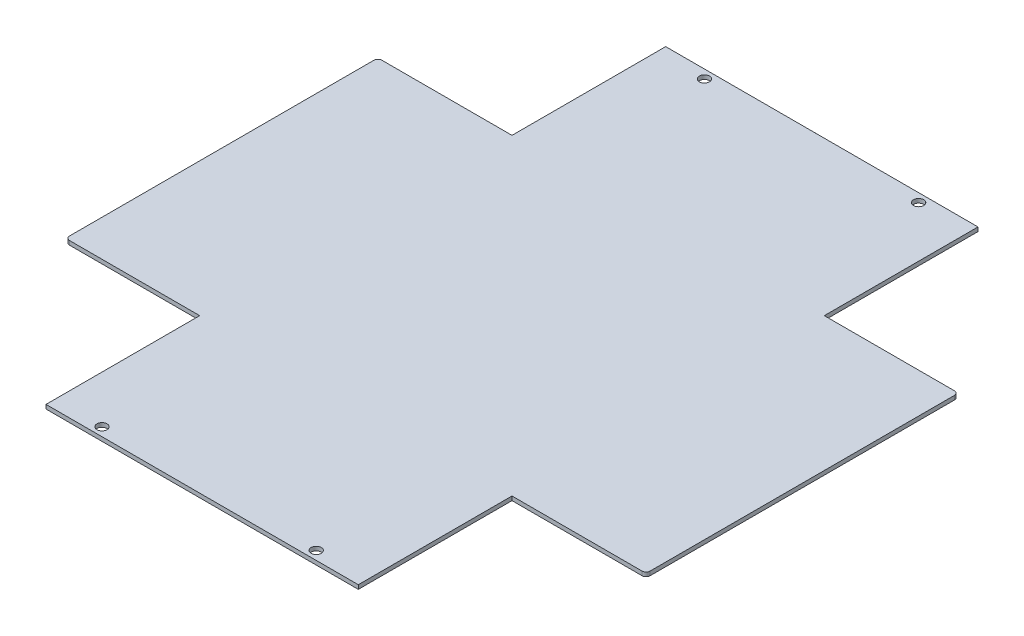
ISO-10303-21;
HEADER;
FILE_DESCRIPTION(('STEP AP214'),'2;1');
FILE_NAME('part.step','',(''),(''),'','','');
FILE_SCHEMA(('AUTOMOTIVE_DESIGN { 1 0 10303 214 1 1 1 1 }'));
ENDSEC;
DATA;
#1=APPLICATION_CONTEXT('core data for automotive mechanical design processes');
#2=APPLICATION_PROTOCOL_DEFINITION('international standard','automotive_design',2000,#1);
#3=PRODUCT_CONTEXT('',#1,'mechanical');
#4=PRODUCT('Part','Part','',(#3));
#5=PRODUCT_RELATED_PRODUCT_CATEGORY('part','',(#4));
#6=PRODUCT_DEFINITION_FORMATION('','',#4);
#7=PRODUCT_DEFINITION_CONTEXT('part definition',#1,'design');
#8=PRODUCT_DEFINITION('design','',#6,#7);
#9=PRODUCT_DEFINITION_SHAPE('','',#8);
#10=(LENGTH_UNIT() NAMED_UNIT(*) SI_UNIT(.MILLI.,.METRE.));
#11=(NAMED_UNIT(*) PLANE_ANGLE_UNIT() SI_UNIT($,.RADIAN.));
#12=(NAMED_UNIT(*) SI_UNIT($,.STERADIAN.) SOLID_ANGLE_UNIT());
#13=UNCERTAINTY_MEASURE_WITH_UNIT(LENGTH_MEASURE(1.E-05),#10,'distance_accuracy_value','');
#14=(GEOMETRIC_REPRESENTATION_CONTEXT(3) GLOBAL_UNCERTAINTY_ASSIGNED_CONTEXT((#13)) GLOBAL_UNIT_ASSIGNED_CONTEXT((#10,
#11,#12)) REPRESENTATION_CONTEXT('',''));
#15=CARTESIAN_POINT('',(0.,0.,0.));
#16=DIRECTION('',(0.,0.,1.));
#17=DIRECTION('',(1.,0.,0.));
#18=AXIS2_PLACEMENT_3D('',#15,#16,#17);
#19=CARTESIAN_POINT('',(0.,1.524,0.));
#20=DIRECTION('',(0.,-1.,0.));
#21=DIRECTION('',(0.,0.,-1.));
#22=AXIS2_PLACEMENT_3D('',#19,#20,#21);
#23=PLANE('',#22);
#24=DIRECTION('',(1.,0.,0.));
#25=VECTOR('',#24,1.);
#26=CARTESIAN_POINT('',(-59.6817953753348,1.524,58.6213948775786));
#27=LINE('',#26,#25);
#28=CARTESIAN_POINT('',(-58.6213948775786,1.52400000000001,58.6213948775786));
#29=VERTEX_POINT('',#28);
#30=CARTESIAN_POINT('',(-107.433795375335,1.52399999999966,58.6213948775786));
#31=VERTEX_POINT('',#30);
#32=EDGE_CURVE('E439',#29,#31,#27,.F.);
#33=ORIENTED_EDGE('',*,*,#32,.F.);
#34=DIRECTION('',(0.,0.,-1.));
#35=VECTOR('',#34,1.);
#36=CARTESIAN_POINT('',(-58.6213948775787,1.52399999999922,167.115590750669));
#37=LINE('',#36,#35);
#38=CARTESIAN_POINT('',(-58.6213948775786,1.52399999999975,116.31559075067));
#39=VERTEX_POINT('',#38);
#40=EDGE_CURVE('E236',#29,#39,#37,.F.);
#41=ORIENTED_EDGE('',*,*,#40,.T.);
#42=DIRECTION('',(-1.,0.,0.));
#43=VECTOR('',#42,1.);
#44=CARTESIAN_POINT('',(0.,1.52399999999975,116.31559075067));
#45=LINE('',#44,#43);
#46=CARTESIAN_POINT('',(58.6213948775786,1.52399999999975,116.31559075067));
#47=VERTEX_POINT('',#46);
#48=EDGE_CURVE('E227',#39,#47,#45,.F.);
#49=ORIENTED_EDGE('',*,*,#48,.T.);
#50=DIRECTION('',(0.,0.,1.));
#51=VECTOR('',#50,1.);
#52=CARTESIAN_POINT('',(58.6213948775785,1.52399999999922,167.11559075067));
#53=LINE('',#52,#51);
#54=CARTESIAN_POINT('',(58.6213948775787,1.524,58.6213948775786));
#55=VERTEX_POINT('',#54);
#56=EDGE_CURVE('E13',#47,#55,#53,.F.);
#57=ORIENTED_EDGE('',*,*,#56,.T.);
#58=DIRECTION('',(1.,0.,0.));
#59=VECTOR('',#58,1.);
#60=CARTESIAN_POINT('',(58.1577953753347,1.52400000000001,58.6213948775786));
#61=LINE('',#60,#59);
#62=CARTESIAN_POINT('',(107.433795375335,1.52399999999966,58.6213948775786));
#63=VERTEX_POINT('',#62);
#64=EDGE_CURVE('E475',#55,#63,#61,.T.);
#65=ORIENTED_EDGE('',*,*,#64,.T.);
#66=CARTESIAN_POINT('',(107.433795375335,1.52399999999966,57.0973948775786));
#67=DIRECTION('',(0.,1.,0.));
#68=DIRECTION('',(-1.,0.,0.));
#69=AXIS2_PLACEMENT_3D('',#66,#67,#68);
#70=CIRCLE('',#69,1.524);
#71=CARTESIAN_POINT('',(108.957795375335,1.52399999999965,57.0973948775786));
#72=VERTEX_POINT('',#71);
#73=EDGE_CURVE('E473',#63,#72,#70,.T.);
#74=ORIENTED_EDGE('',*,*,#73,.T.);
#75=DIRECTION('',(0.,0.,-1.));
#76=VECTOR('',#75,1.);
#77=CARTESIAN_POINT('',(108.957795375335,1.52399999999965,60.325));
#78=LINE('',#77,#76);
#79=CARTESIAN_POINT('',(108.957795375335,1.52399999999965,-57.0973948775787));
#80=VERTEX_POINT('',#79);
#81=EDGE_CURVE('E438',#80,#72,#78,.F.);
#82=ORIENTED_EDGE('',*,*,#81,.F.);
#83=CARTESIAN_POINT('',(107.433795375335,1.52399999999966,-57.0973948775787));
#84=DIRECTION('',(0.,1.,0.));
#85=DIRECTION('',(-1.,0.,0.));
#86=AXIS2_PLACEMENT_3D('',#83,#84,#85);
#87=CIRCLE('',#86,1.524);
#88=CARTESIAN_POINT('',(107.433795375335,1.52399999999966,-58.6213948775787));
#89=VERTEX_POINT('',#88);
#90=EDGE_CURVE('E292',#80,#89,#87,.T.);
#91=ORIENTED_EDGE('',*,*,#90,.T.);
#92=DIRECTION('',(-1.,0.,0.));
#93=VECTOR('',#92,1.);
#94=CARTESIAN_POINT('',(59.6817953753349,1.524,-58.6213948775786));
#95=LINE('',#94,#93);
#96=CARTESIAN_POINT('',(58.6213948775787,1.52400000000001,-58.6213948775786));
#97=VERTEX_POINT('',#96);
#98=EDGE_CURVE('E458',#97,#89,#95,.F.);
#99=ORIENTED_EDGE('',*,*,#98,.F.);
#100=DIRECTION('',(0.,0.,1.));
#101=VECTOR('',#100,1.);
#102=CARTESIAN_POINT('',(58.6213948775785,1.52399999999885,-167.11559075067));
#103=LINE('',#102,#101);
#104=CARTESIAN_POINT('',(58.6213948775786,1.52399999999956,-116.31559075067));
#105=VERTEX_POINT('',#104);
#106=EDGE_CURVE('E340',#97,#105,#103,.F.);
#107=ORIENTED_EDGE('',*,*,#106,.T.);
#108=DIRECTION('',(1.,0.,0.));
#109=VECTOR('',#108,1.);
#110=CARTESIAN_POINT('',(0.,1.52399999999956,-116.31559075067));
#111=LINE('',#110,#109);
#112=CARTESIAN_POINT('',(-58.6213948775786,1.52399999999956,-116.31559075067));
#113=VERTEX_POINT('',#112);
#114=EDGE_CURVE('E418',#105,#113,#111,.F.);
#115=ORIENTED_EDGE('',*,*,#114,.T.);
#116=DIRECTION('',(0.,0.,-1.));
#117=VECTOR('',#116,1.);
#118=CARTESIAN_POINT('',(-58.6213948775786,1.52399999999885,-167.11559075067));
#119=LINE('',#118,#117);
#120=CARTESIAN_POINT('',(-58.6213948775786,1.52400000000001,-58.6213948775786));
#121=VERTEX_POINT('',#120);
#122=EDGE_CURVE('E415',#113,#121,#119,.F.);
#123=ORIENTED_EDGE('',*,*,#122,.T.);
#124=DIRECTION('',(-1.,0.,0.));
#125=VECTOR('',#124,1.);
#126=CARTESIAN_POINT('',(-58.1577953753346,1.52400000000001,-58.6213948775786));
#127=LINE('',#126,#125);
#128=CARTESIAN_POINT('',(-107.433795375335,1.52399999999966,-58.6213948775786));
#129=VERTEX_POINT('',#128);
#130=EDGE_CURVE('E401',#121,#129,#127,.T.);
#131=ORIENTED_EDGE('',*,*,#130,.T.);
#132=CARTESIAN_POINT('',(-107.433795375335,1.52399999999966,-57.0973948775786));
#133=DIRECTION('',(0.,1.,0.));
#134=DIRECTION('',(-1.,0.,0.));
#135=AXIS2_PLACEMENT_3D('',#132,#133,#134);
#136=CIRCLE('',#135,1.524);
#137=CARTESIAN_POINT('',(-108.957795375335,1.52399999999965,-57.0973948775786));
#138=VERTEX_POINT('',#137);
#139=EDGE_CURVE('E450',#129,#138,#136,.T.);
#140=ORIENTED_EDGE('',*,*,#139,.T.);
#141=DIRECTION('',(0.,0.,1.));
#142=VECTOR('',#141,1.);
#143=CARTESIAN_POINT('',(-108.957795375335,1.52399999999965,-60.325));
#144=LINE('',#143,#142);
#145=CARTESIAN_POINT('',(-108.957795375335,1.52399999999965,57.0973948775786));
#146=VERTEX_POINT('',#145);
#147=EDGE_CURVE('E417',#146,#138,#144,.F.);
#148=ORIENTED_EDGE('',*,*,#147,.F.);
#149=CARTESIAN_POINT('',(-107.433795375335,1.52399999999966,57.0973948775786));
#150=DIRECTION('',(0.,1.,0.));
#151=DIRECTION('',(-1.,0.,0.));
#152=AXIS2_PLACEMENT_3D('',#149,#150,#151);
#153=CIRCLE('',#152,1.524);
#154=EDGE_CURVE('E332',#146,#31,#153,.T.);
#155=ORIENTED_EDGE('',*,*,#154,.T.);
#156=EDGE_LOOP('',(#33,#41,#49,#57,#65,#74,#82,#91,#99,#107,#115,#123,#131,#140,#148,#155));
#157=FACE_BOUND('',#156,.T.);
#158=CARTESIAN_POINT('',(39.5732000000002,1.52399999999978,113.077090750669));
#159=DIRECTION('',(0.,-1.,0.));
#160=DIRECTION('',(0.,0.,-1.));
#161=AXIS2_PLACEMENT_3D('',#158,#159,#160);
#162=CIRCLE('',#161,1.90499999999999);
#163=CARTESIAN_POINT('',(39.5732000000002,1.5239999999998,111.172090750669));
#164=VERTEX_POINT('',#163);
#165=EDGE_CURVE('E487',#164,#164,#162,.T.);
#166=ORIENTED_EDGE('',*,*,#165,.T.);
#167=EDGE_LOOP('',(#166));
#168=FACE_BOUND('',#167,.T.);
#169=CARTESIAN_POINT('',(-40.8431999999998,1.52399999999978,113.077090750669));
#170=DIRECTION('',(0.,-1.,0.));
#171=DIRECTION('',(0.,0.,-1.));
#172=AXIS2_PLACEMENT_3D('',#169,#170,#171);
#173=CIRCLE('',#172,1.90499999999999);
#174=CARTESIAN_POINT('',(-40.8431999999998,1.5239999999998,111.17209075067));
#175=VERTEX_POINT('',#174);
#176=EDGE_CURVE('E484',#175,#175,#173,.T.);
#177=ORIENTED_EDGE('',*,*,#176,.T.);
#178=EDGE_LOOP('',(#177));
#179=FACE_BOUND('',#178,.T.);
#180=CARTESIAN_POINT('',(-40.8431999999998,1.5239999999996,-113.07709075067));
#181=DIRECTION('',(0.,-1.,0.));
#182=DIRECTION('',(0.,0.,-1.));
#183=AXIS2_PLACEMENT_3D('',#180,#181,#182);
#184=CIRCLE('',#183,1.90499999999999);
#185=CARTESIAN_POINT('',(-40.8431999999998,1.52399999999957,-114.98209075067));
#186=VERTEX_POINT('',#185);
#187=EDGE_CURVE('E424',#186,#186,#184,.T.);
#188=ORIENTED_EDGE('',*,*,#187,.T.);
#189=EDGE_LOOP('',(#188));
#190=FACE_BOUND('',#189,.T.);
#191=CARTESIAN_POINT('',(39.5732000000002,1.5239999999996,-113.07709075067));
#192=DIRECTION('',(0.,-1.,0.));
#193=DIRECTION('',(0.,0.,-1.));
#194=AXIS2_PLACEMENT_3D('',#191,#192,#193);
#195=CIRCLE('',#194,1.90499999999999);
#196=CARTESIAN_POINT('',(39.5732000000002,1.52399999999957,-114.98209075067));
#197=VERTEX_POINT('',#196);
#198=EDGE_CURVE('E421',#197,#197,#195,.T.);
#199=ORIENTED_EDGE('',*,*,#198,.T.);
#200=EDGE_LOOP('',(#199));
#201=FACE_BOUND('',#200,.T.);
#202=ADVANCED_FACE('F217',(#157,#168,#179,#190,#201),#23,.F.);
#203=CARTESIAN_POINT('',(0.,0.,0.));
#204=DIRECTION('',(0.,-1.,0.));
#205=DIRECTION('',(0.,0.,-1.));
#206=AXIS2_PLACEMENT_3D('',#203,#204,#205);
#207=PLANE('',#206);
#208=DIRECTION('',(0.,0.,-1.));
#209=VECTOR('',#208,1.);
#210=CARTESIAN_POINT('',(58.6213948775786,-4.37150315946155E-13,-116.31559075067));
#211=LINE('',#210,#209);
#212=CARTESIAN_POINT('',(58.6213948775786,0.,-58.6213948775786));
#213=VERTEX_POINT('',#212);
#214=CARTESIAN_POINT('',(58.6213948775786,-4.37150315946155E-13,-116.31559075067));
#215=VERTEX_POINT('',#214);
#216=EDGE_CURVE('E386',#213,#215,#211,.T.);
#217=ORIENTED_EDGE('',*,*,#216,.F.);
#218=DIRECTION('',(1.,0.,0.));
#219=VECTOR('',#218,1.);
#220=CARTESIAN_POINT('',(58.1577953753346,0.,-58.6213948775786));
#221=LINE('',#220,#219);
#222=CARTESIAN_POINT('',(107.433795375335,-3.33066907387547E-13,-58.6213948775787));
#223=VERTEX_POINT('',#222);
#224=EDGE_CURVE('E462',#213,#223,#221,.T.);
#225=ORIENTED_EDGE('',*,*,#224,.T.);
#226=CARTESIAN_POINT('',(107.433795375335,-3.33066907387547E-13,-57.0973948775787));
#227=DIRECTION('',(0.,1.,0.));
#228=DIRECTION('',(-1.,0.,0.));
#229=AXIS2_PLACEMENT_3D('',#226,#227,#228);
#230=CIRCLE('',#229,1.524);
#231=CARTESIAN_POINT('',(108.957795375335,-3.46944695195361E-13,-57.0973948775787));
#232=VERTEX_POINT('',#231);
#233=EDGE_CURVE('E460',#223,#232,#230,.F.);
#234=ORIENTED_EDGE('',*,*,#233,.T.);
#235=DIRECTION('',(0.,0.,1.));
#236=VECTOR('',#235,1.);
#237=CARTESIAN_POINT('',(108.957795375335,-3.46944695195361E-13,0.));
#238=LINE('',#237,#236);
#239=CARTESIAN_POINT('',(108.957795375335,-3.46944695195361E-13,57.0973948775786));
#240=VERTEX_POINT('',#239);
#241=EDGE_CURVE('E466',#232,#240,#238,.T.);
#242=ORIENTED_EDGE('',*,*,#241,.T.);
#243=CARTESIAN_POINT('',(107.433795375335,-3.33066907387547E-13,57.0973948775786));
#244=DIRECTION('',(0.,1.,0.));
#245=DIRECTION('',(-1.,0.,0.));
#246=AXIS2_PLACEMENT_3D('',#243,#244,#245);
#247=CIRCLE('',#246,1.524);
#248=CARTESIAN_POINT('',(107.433795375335,-3.33066907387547E-13,58.6213948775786));
#249=VERTEX_POINT('',#248);
#250=EDGE_CURVE('E464',#240,#249,#247,.F.);
#251=ORIENTED_EDGE('',*,*,#250,.T.);
#252=DIRECTION('',(-1.,0.,0.));
#253=VECTOR('',#252,1.);
#254=CARTESIAN_POINT('',(59.6817953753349,0.,58.6213948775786));
#255=LINE('',#254,#253);
#256=CARTESIAN_POINT('',(58.6213948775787,0.,58.6213948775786));
#257=VERTEX_POINT('',#256);
#258=EDGE_CURVE('E362',#257,#249,#255,.F.);
#259=ORIENTED_EDGE('',*,*,#258,.F.);
#260=DIRECTION('',(0.,0.,-1.));
#261=VECTOR('',#260,1.);
#262=CARTESIAN_POINT('',(58.6213948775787,-1.59594559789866E-13,108.31459075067));
#263=LINE('',#262,#261);
#264=CARTESIAN_POINT('',(58.6213948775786,-2.42861286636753E-13,116.31559075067));
#265=VERTEX_POINT('',#264);
#266=EDGE_CURVE('E494',#265,#257,#263,.T.);
#267=ORIENTED_EDGE('',*,*,#266,.F.);
#268=DIRECTION('',(1.,0.,0.));
#269=VECTOR('',#268,1.);
#270=CARTESIAN_POINT('',(58.6213948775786,-2.42861286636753E-13,116.31559075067));
#271=LINE('',#270,#269);
#272=CARTESIAN_POINT('',(-58.6213948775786,-2.42861286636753E-13,116.31559075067));
#273=VERTEX_POINT('',#272);
#274=EDGE_CURVE('E221',#273,#265,#271,.T.);
#275=ORIENTED_EDGE('',*,*,#274,.F.);
#276=DIRECTION('',(0.,0.,1.));
#277=VECTOR('',#276,1.);
#278=CARTESIAN_POINT('',(-58.6213948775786,-2.42861286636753E-13,116.31559075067));
#279=LINE('',#278,#277);
#280=CARTESIAN_POINT('',(-58.6213948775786,0.,58.6213948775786));
#281=VERTEX_POINT('',#280);
#282=EDGE_CURVE('E492',#281,#273,#279,.T.);
#283=ORIENTED_EDGE('',*,*,#282,.F.);
#284=DIRECTION('',(-1.,0.,0.));
#285=VECTOR('',#284,1.);
#286=CARTESIAN_POINT('',(-58.1577953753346,0.,58.6213948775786));
#287=LINE('',#286,#285);
#288=CARTESIAN_POINT('',(-107.433795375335,-3.33066907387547E-13,58.6213948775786));
#289=VERTEX_POINT('',#288);
#290=EDGE_CURVE('E443',#281,#289,#287,.T.);
#291=ORIENTED_EDGE('',*,*,#290,.T.);
#292=CARTESIAN_POINT('',(-107.433795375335,-3.33066907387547E-13,57.0973948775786));
#293=DIRECTION('',(0.,1.,0.));
#294=DIRECTION('',(-1.,0.,0.));
#295=AXIS2_PLACEMENT_3D('',#292,#293,#294);
#296=CIRCLE('',#295,1.524);
#297=CARTESIAN_POINT('',(-108.957795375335,-3.46944695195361E-13,57.0973948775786));
#298=VERTEX_POINT('',#297);
#299=EDGE_CURVE('E441',#289,#298,#296,.F.);
#300=ORIENTED_EDGE('',*,*,#299,.T.);
#301=DIRECTION('',(0.,0.,-1.));
#302=VECTOR('',#301,1.);
#303=CARTESIAN_POINT('',(-108.957795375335,-3.46944695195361E-13,0.));
#304=LINE('',#303,#302);
#305=CARTESIAN_POINT('',(-108.957795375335,-3.46944695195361E-13,-57.0973948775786));
#306=VERTEX_POINT('',#305);
#307=EDGE_CURVE('E446',#298,#306,#304,.T.);
#308=ORIENTED_EDGE('',*,*,#307,.T.);
#309=CARTESIAN_POINT('',(-107.433795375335,-3.33066907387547E-13,-57.0973948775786));
#310=DIRECTION('',(0.,1.,0.));
#311=DIRECTION('',(-1.,0.,0.));
#312=AXIS2_PLACEMENT_3D('',#309,#310,#311);
#313=CIRCLE('',#312,1.524);
#314=CARTESIAN_POINT('',(-107.433795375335,-3.33066907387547E-13,-58.6213948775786));
#315=VERTEX_POINT('',#314);
#316=EDGE_CURVE('E393',#306,#315,#313,.F.);
#317=ORIENTED_EDGE('',*,*,#316,.T.);
#318=DIRECTION('',(1.,0.,0.));
#319=VECTOR('',#318,1.);
#320=CARTESIAN_POINT('',(-59.6817953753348,0.,-58.6213948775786));
#321=LINE('',#320,#319);
#322=CARTESIAN_POINT('',(-58.6213948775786,0.,-58.6213948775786));
#323=VERTEX_POINT('',#322);
#324=EDGE_CURVE('E390',#323,#315,#321,.F.);
#325=ORIENTED_EDGE('',*,*,#324,.F.);
#326=DIRECTION('',(0.,0.,1.));
#327=VECTOR('',#326,1.);
#328=CARTESIAN_POINT('',(-58.6213948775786,-3.2612801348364E-13,-108.31459075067));
#329=LINE('',#328,#327);
#330=CARTESIAN_POINT('',(-58.6213948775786,-4.37150315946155E-13,-116.31559075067));
#331=VERTEX_POINT('',#330);
#332=EDGE_CURVE('E380',#331,#323,#329,.T.);
#333=ORIENTED_EDGE('',*,*,#332,.F.);
#334=DIRECTION('',(-1.,0.,0.));
#335=VECTOR('',#334,1.);
#336=CARTESIAN_POINT('',(-58.6213948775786,-4.37150315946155E-13,-116.31559075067));
#337=LINE('',#336,#335);
#338=EDGE_CURVE('E414',#215,#331,#337,.T.);
#339=ORIENTED_EDGE('',*,*,#338,.F.);
#340=EDGE_LOOP('',(#217,#225,#234,#242,#251,#259,#267,#275,#283,#291,#300,#308,#317,#325,#333,#339));
#341=FACE_BOUND('',#340,.T.);
#342=CARTESIAN_POINT('',(39.5732000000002,-2.08166817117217E-13,113.077090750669));
#343=DIRECTION('',(0.,-1.,0.));
#344=DIRECTION('',(0.,0.,-1.));
#345=AXIS2_PLACEMENT_3D('',#342,#343,#344);
#346=CIRCLE('',#345,1.90499999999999);
#347=CARTESIAN_POINT('',(39.5732000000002,-1.87925379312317E-13,111.172090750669));
#348=VERTEX_POINT('',#347);
#349=EDGE_CURVE('E496',#348,#348,#346,.T.);
#350=ORIENTED_EDGE('',*,*,#349,.F.);
#351=EDGE_LOOP('',(#350));
#352=FACE_BOUND('',#351,.T.);
#353=CARTESIAN_POINT('',(-40.8431999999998,-2.08166817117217E-13,113.077090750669));
#354=DIRECTION('',(0.,-1.,0.));
#355=DIRECTION('',(0.,0.,-1.));
#356=AXIS2_PLACEMENT_3D('',#353,#354,#355);
#357=CIRCLE('',#356,1.90499999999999);
#358=CARTESIAN_POINT('',(-40.8431999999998,-1.87925379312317E-13,111.172090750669));
#359=VERTEX_POINT('',#358);
#360=EDGE_CURVE('E499',#359,#359,#357,.T.);
#361=ORIENTED_EDGE('',*,*,#360,.F.);
#362=EDGE_LOOP('',(#361));
#363=FACE_BOUND('',#362,.T.);
#364=CARTESIAN_POINT('',(-40.8431999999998,-7.63278329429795E-13,-113.07709075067));
#365=DIRECTION('',(0.,-1.,0.));
#366=DIRECTION('',(0.,0.,-1.));
#367=AXIS2_PLACEMENT_3D('',#364,#365,#366);
#368=CIRCLE('',#367,1.90499999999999);
#369=CARTESIAN_POINT('',(-40.8431999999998,-7.6964197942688E-13,-114.98209075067));
#370=VERTEX_POINT('',#369);
#371=EDGE_CURVE('E387',#370,#370,#368,.T.);
#372=ORIENTED_EDGE('',*,*,#371,.F.);
#373=EDGE_LOOP('',(#372));
#374=FACE_BOUND('',#373,.T.);
#375=CARTESIAN_POINT('',(39.5732000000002,-7.63278329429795E-13,-113.07709075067));
#376=DIRECTION('',(0.,-1.,0.));
#377=DIRECTION('',(0.,0.,-1.));
#378=AXIS2_PLACEMENT_3D('',#375,#376,#377);
#379=CIRCLE('',#378,1.90499999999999);
#380=CARTESIAN_POINT('',(39.5732000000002,-7.6964197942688E-13,-114.98209075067));
#381=VERTEX_POINT('',#380);
#382=EDGE_CURVE('E432',#381,#381,#379,.T.);
#383=ORIENTED_EDGE('',*,*,#382,.F.);
#384=EDGE_LOOP('',(#383));
#385=FACE_BOUND('',#384,.T.);
#386=ADVANCED_FACE('F219',(#341,#352,#363,#374,#385),#207,.T.);
#387=CARTESIAN_POINT('',(58.6213948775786,-2.42861286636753E-13,116.31559075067));
#388=DIRECTION('',(0.,0.,1.));
#389=DIRECTION('',(0.,-1.,0.));
#390=AXIS2_PLACEMENT_3D('',#387,#388,#389);
#391=PLANE('',#390);
#392=ORIENTED_EDGE('',*,*,#48,.F.);
#393=DIRECTION('',(0.,1.,0.));
#394=VECTOR('',#393,1.);
#395=CARTESIAN_POINT('',(-58.6213948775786,-2.42861286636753E-13,116.31559075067));
#396=LINE('',#395,#394);
#397=EDGE_CURVE('E490',#273,#39,#396,.T.);
#398=ORIENTED_EDGE('',*,*,#397,.F.);
#399=ORIENTED_EDGE('',*,*,#274,.T.);
#400=DIRECTION('',(0.,1.,0.));
#401=VECTOR('',#400,1.);
#402=CARTESIAN_POINT('',(58.6213948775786,-2.42861286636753E-13,116.31559075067));
#403=LINE('',#402,#401);
#404=EDGE_CURVE('E249',#265,#47,#403,.T.);
#405=ORIENTED_EDGE('',*,*,#404,.T.);
#406=EDGE_LOOP('',(#392,#398,#399,#405));
#407=FACE_BOUND('',#406,.T.);
#408=ADVANCED_FACE('F503',(#407),#391,.T.);
#409=CARTESIAN_POINT('',(-40.8431999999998,-2.08166817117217E-13,113.077090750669));
#410=DIRECTION('',(0.,-1.,0.));
#411=DIRECTION('',(0.,0.,-1.));
#412=AXIS2_PLACEMENT_3D('',#409,#410,#411);
#413=CYLINDRICAL_SURFACE('',#412,1.90499999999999);
#414=ORIENTED_EDGE('',*,*,#176,.F.);
#415=EDGE_LOOP('',(#414));
#416=FACE_BOUND('',#415,.T.);
#417=ORIENTED_EDGE('',*,*,#360,.T.);
#418=EDGE_LOOP('',(#417));
#419=FACE_BOUND('',#418,.T.);
#420=ADVANCED_FACE('F532',(#416,#419),#413,.F.);
#421=CARTESIAN_POINT('',(39.5732000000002,-2.08166817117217E-13,113.077090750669));
#422=DIRECTION('',(0.,-1.,0.));
#423=DIRECTION('',(0.,0.,-1.));
#424=AXIS2_PLACEMENT_3D('',#421,#422,#423);
#425=CYLINDRICAL_SURFACE('',#424,1.90499999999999);
#426=ORIENTED_EDGE('',*,*,#165,.F.);
#427=EDGE_LOOP('',(#426));
#428=FACE_BOUND('',#427,.T.);
#429=ORIENTED_EDGE('',*,*,#349,.T.);
#430=EDGE_LOOP('',(#429));
#431=FACE_BOUND('',#430,.T.);
#432=ADVANCED_FACE('F537',(#428,#431),#425,.F.);
#433=CARTESIAN_POINT('',(58.6213948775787,-1.59594559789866E-13,108.31459075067));
#434=DIRECTION('',(1.,0.,0.));
#435=DIRECTION('',(0.,0.,1.));
#436=AXIS2_PLACEMENT_3D('',#433,#434,#435);
#437=PLANE('',#436);
#438=ORIENTED_EDGE('',*,*,#266,.T.);
#439=DIRECTION('',(0.,1.,0.));
#440=VECTOR('',#439,1.);
#441=CARTESIAN_POINT('',(58.6213948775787,0.,58.6213948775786));
#442=LINE('',#441,#440);
#443=EDGE_CURVE('E411',#257,#55,#442,.T.);
#444=ORIENTED_EDGE('',*,*,#443,.T.);
#445=ORIENTED_EDGE('',*,*,#56,.F.);
#446=ORIENTED_EDGE('',*,*,#404,.F.);
#447=EDGE_LOOP('',(#438,#444,#445,#446));
#448=FACE_BOUND('',#447,.T.);
#449=ADVANCED_FACE('F506',(#448),#437,.T.);
#450=CARTESIAN_POINT('',(-58.6213948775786,-2.42861286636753E-13,116.31559075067));
#451=DIRECTION('',(-1.,0.,0.));
#452=DIRECTION('',(0.,0.,-1.));
#453=AXIS2_PLACEMENT_3D('',#450,#451,#452);
#454=PLANE('',#453);
#455=ORIENTED_EDGE('',*,*,#40,.F.);
#456=DIRECTION('',(0.,1.,0.));
#457=VECTOR('',#456,1.);
#458=CARTESIAN_POINT('',(-58.6213948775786,0.,58.6213948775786));
#459=LINE('',#458,#457);
#460=EDGE_CURVE('E403',#281,#29,#459,.T.);
#461=ORIENTED_EDGE('',*,*,#460,.F.);
#462=ORIENTED_EDGE('',*,*,#282,.T.);
#463=ORIENTED_EDGE('',*,*,#397,.T.);
#464=EDGE_LOOP('',(#455,#461,#462,#463));
#465=FACE_BOUND('',#464,.T.);
#466=ADVANCED_FACE('F549',(#465),#454,.T.);
#467=CARTESIAN_POINT('',(107.433795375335,-3.33066907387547E-13,-57.0973948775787));
#468=DIRECTION('',(0.,1.,0.));
#469=DIRECTION('',(-1.,0.,0.));
#470=AXIS2_PLACEMENT_3D('',#467,#468,#469);
#471=CYLINDRICAL_SURFACE('',#470,1.524);
#472=ORIENTED_EDGE('',*,*,#233,.F.);
#473=DIRECTION('',(0.,1.,0.));
#474=VECTOR('',#473,1.);
#475=CARTESIAN_POINT('',(107.433795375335,1.52399999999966,-58.6213948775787));
#476=LINE('',#475,#474);
#477=EDGE_CURVE('E261',#89,#223,#476,.F.);
#478=ORIENTED_EDGE('',*,*,#477,.F.);
#479=ORIENTED_EDGE('',*,*,#90,.F.);
#480=DIRECTION('',(0.,1.,0.));
#481=VECTOR('',#480,1.);
#482=CARTESIAN_POINT('',(108.957795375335,-3.46944695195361E-13,-57.0973948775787));
#483=LINE('',#482,#481);
#484=EDGE_CURVE('E478',#232,#80,#483,.T.);
#485=ORIENTED_EDGE('',*,*,#484,.F.);
#486=EDGE_LOOP('',(#472,#478,#479,#485));
#487=FACE_BOUND('',#486,.T.);
#488=ADVANCED_FACE('F551',(#487),#471,.T.);
#489=CARTESIAN_POINT('',(108.957795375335,-3.46944695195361E-13,60.325));
#490=DIRECTION('',(-1.,0.,0.));
#491=DIRECTION('',(0.,-1.,0.));
#492=AXIS2_PLACEMENT_3D('',#489,#490,#491);
#493=PLANE('',#492);
#494=ORIENTED_EDGE('',*,*,#81,.T.);
#495=DIRECTION('',(0.,1.,0.));
#496=VECTOR('',#495,1.);
#497=CARTESIAN_POINT('',(108.957795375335,-3.46944695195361E-13,57.0973948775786));
#498=LINE('',#497,#496);
#499=EDGE_CURVE('E286',#72,#240,#498,.F.);
#500=ORIENTED_EDGE('',*,*,#499,.T.);
#501=ORIENTED_EDGE('',*,*,#241,.F.);
#502=ORIENTED_EDGE('',*,*,#484,.T.);
#503=EDGE_LOOP('',(#494,#500,#501,#502));
#504=FACE_BOUND('',#503,.T.);
#505=ADVANCED_FACE('F556',(#504),#493,.F.);
#506=CARTESIAN_POINT('',(107.433795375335,1.52399999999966,57.0973948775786));
#507=DIRECTION('',(0.,-1.,0.));
#508=DIRECTION('',(1.,0.,0.));
#509=AXIS2_PLACEMENT_3D('',#506,#507,#508);
#510=CYLINDRICAL_SURFACE('',#509,1.524);
#511=ORIENTED_EDGE('',*,*,#250,.F.);
#512=ORIENTED_EDGE('',*,*,#499,.F.);
#513=ORIENTED_EDGE('',*,*,#73,.F.);
#514=DIRECTION('',(0.,1.,0.));
#515=VECTOR('',#514,1.);
#516=CARTESIAN_POINT('',(107.433795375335,1.52399999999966,58.6213948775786));
#517=LINE('',#516,#515);
#518=EDGE_CURVE('E468',#249,#63,#517,.T.);
#519=ORIENTED_EDGE('',*,*,#518,.F.);
#520=EDGE_LOOP('',(#511,#512,#513,#519));
#521=FACE_BOUND('',#520,.T.);
#522=ADVANCED_FACE('F580',(#521),#510,.T.);
#523=CARTESIAN_POINT('',(59.6817953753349,1.524,58.6213948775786));
#524=DIRECTION('',(0.,0.,1.));
#525=DIRECTION('',(-1.,0.,0.));
#526=AXIS2_PLACEMENT_3D('',#523,#524,#525);
#527=PLANE('',#526);
#528=ORIENTED_EDGE('',*,*,#258,.T.);
#529=ORIENTED_EDGE('',*,*,#518,.T.);
#530=ORIENTED_EDGE('',*,*,#64,.F.);
#531=ORIENTED_EDGE('',*,*,#443,.F.);
#532=EDGE_LOOP('',(#528,#529,#530,#531));
#533=FACE_BOUND('',#532,.T.);
#534=ADVANCED_FACE('F508',(#533),#527,.T.);
#535=CARTESIAN_POINT('',(59.6817953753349,1.524,-58.6213948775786));
#536=DIRECTION('',(0.,0.,1.));
#537=DIRECTION('',(-1.,0.,0.));
#538=AXIS2_PLACEMENT_3D('',#535,#536,#537);
#539=PLANE('',#538);
#540=ORIENTED_EDGE('',*,*,#98,.T.);
#541=ORIENTED_EDGE('',*,*,#477,.T.);
#542=ORIENTED_EDGE('',*,*,#224,.F.);
#543=DIRECTION('',(0.,1.,0.));
#544=VECTOR('',#543,1.);
#545=CARTESIAN_POINT('',(58.6213948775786,0.,-58.6213948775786));
#546=LINE('',#545,#544);
#547=EDGE_CURVE('E406',#213,#97,#546,.T.);
#548=ORIENTED_EDGE('',*,*,#547,.T.);
#549=EDGE_LOOP('',(#540,#541,#542,#548));
#550=FACE_BOUND('',#549,.T.);
#551=ADVANCED_FACE('F541',(#550),#539,.F.);
#552=CARTESIAN_POINT('',(-107.433795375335,-3.33066907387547E-13,57.0973948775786));
#553=DIRECTION('',(0.,1.,0.));
#554=DIRECTION('',(-1.,0.,0.));
#555=AXIS2_PLACEMENT_3D('',#552,#553,#554);
#556=CYLINDRICAL_SURFACE('',#555,1.524);
#557=ORIENTED_EDGE('',*,*,#299,.F.);
#558=DIRECTION('',(0.,1.,0.));
#559=VECTOR('',#558,1.);
#560=CARTESIAN_POINT('',(-107.433795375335,1.52399999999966,58.6213948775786));
#561=LINE('',#560,#559);
#562=EDGE_CURVE('E301',#31,#289,#561,.F.);
#563=ORIENTED_EDGE('',*,*,#562,.F.);
#564=ORIENTED_EDGE('',*,*,#154,.F.);
#565=DIRECTION('',(0.,1.,0.));
#566=VECTOR('',#565,1.);
#567=CARTESIAN_POINT('',(-108.957795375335,-3.46944695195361E-13,57.0973948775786));
#568=LINE('',#567,#566);
#569=EDGE_CURVE('E453',#298,#146,#568,.T.);
#570=ORIENTED_EDGE('',*,*,#569,.F.);
#571=EDGE_LOOP('',(#557,#563,#564,#570));
#572=FACE_BOUND('',#571,.T.);
#573=ADVANCED_FACE('F560',(#572),#556,.T.);
#574=CARTESIAN_POINT('',(-108.957795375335,-3.46944695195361E-13,-60.325));
#575=DIRECTION('',(1.,0.,0.));
#576=DIRECTION('',(0.,1.,0.));
#577=AXIS2_PLACEMENT_3D('',#574,#575,#576);
#578=PLANE('',#577);
#579=ORIENTED_EDGE('',*,*,#147,.T.);
#580=DIRECTION('',(0.,1.,0.));
#581=VECTOR('',#580,1.);
#582=CARTESIAN_POINT('',(-108.957795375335,-3.46944695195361E-13,-57.0973948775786));
#583=LINE('',#582,#581);
#584=EDGE_CURVE('E326',#138,#306,#583,.F.);
#585=ORIENTED_EDGE('',*,*,#584,.T.);
#586=ORIENTED_EDGE('',*,*,#307,.F.);
#587=ORIENTED_EDGE('',*,*,#569,.T.);
#588=EDGE_LOOP('',(#579,#585,#586,#587));
#589=FACE_BOUND('',#588,.T.);
#590=ADVANCED_FACE('F562',(#589),#578,.F.);
#591=CARTESIAN_POINT('',(-107.433795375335,1.52399999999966,-57.0973948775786));
#592=DIRECTION('',(0.,-1.,0.));
#593=DIRECTION('',(1.,0.,0.));
#594=AXIS2_PLACEMENT_3D('',#591,#592,#593);
#595=CYLINDRICAL_SURFACE('',#594,1.524);
#596=ORIENTED_EDGE('',*,*,#316,.F.);
#597=ORIENTED_EDGE('',*,*,#584,.F.);
#598=ORIENTED_EDGE('',*,*,#139,.F.);
#599=DIRECTION('',(0.,1.,0.));
#600=VECTOR('',#599,1.);
#601=CARTESIAN_POINT('',(-107.433795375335,1.52399999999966,-58.6213948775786));
#602=LINE('',#601,#600);
#603=EDGE_CURVE('E397',#315,#129,#602,.T.);
#604=ORIENTED_EDGE('',*,*,#603,.F.);
#605=EDGE_LOOP('',(#596,#597,#598,#604));
#606=FACE_BOUND('',#605,.T.);
#607=ADVANCED_FACE('F564',(#606),#595,.T.);
#608=CARTESIAN_POINT('',(-59.6817953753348,1.524,-58.6213948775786));
#609=DIRECTION('',(0.,0.,-1.));
#610=DIRECTION('',(-1.,0.,0.));
#611=AXIS2_PLACEMENT_3D('',#608,#609,#610);
#612=PLANE('',#611);
#613=ORIENTED_EDGE('',*,*,#324,.T.);
#614=ORIENTED_EDGE('',*,*,#603,.T.);
#615=ORIENTED_EDGE('',*,*,#130,.F.);
#616=DIRECTION('',(0.,1.,0.));
#617=VECTOR('',#616,1.);
#618=CARTESIAN_POINT('',(-58.6213948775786,0.,-58.6213948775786));
#619=LINE('',#618,#617);
#620=EDGE_CURVE('E384',#323,#121,#619,.T.);
#621=ORIENTED_EDGE('',*,*,#620,.F.);
#622=EDGE_LOOP('',(#613,#614,#615,#621));
#623=FACE_BOUND('',#622,.T.);
#624=ADVANCED_FACE('F399',(#623),#612,.T.);
#625=CARTESIAN_POINT('',(-59.6817953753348,1.524,58.6213948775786));
#626=DIRECTION('',(0.,0.,-1.));
#627=DIRECTION('',(-1.,0.,0.));
#628=AXIS2_PLACEMENT_3D('',#625,#626,#627);
#629=PLANE('',#628);
#630=ORIENTED_EDGE('',*,*,#32,.T.);
#631=ORIENTED_EDGE('',*,*,#562,.T.);
#632=ORIENTED_EDGE('',*,*,#290,.F.);
#633=ORIENTED_EDGE('',*,*,#460,.T.);
#634=EDGE_LOOP('',(#630,#631,#632,#633));
#635=FACE_BOUND('',#634,.T.);
#636=ADVANCED_FACE('F571',(#635),#629,.F.);
#637=CARTESIAN_POINT('',(-58.6213948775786,-4.37150315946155E-13,-116.31559075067));
#638=DIRECTION('',(0.,0.,-1.));
#639=DIRECTION('',(0.,1.,0.));
#640=AXIS2_PLACEMENT_3D('',#637,#638,#639);
#641=PLANE('',#640);
#642=ORIENTED_EDGE('',*,*,#114,.F.);
#643=DIRECTION('',(0.,1.,0.));
#644=VECTOR('',#643,1.);
#645=CARTESIAN_POINT('',(58.6213948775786,-4.37150315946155E-13,-116.31559075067));
#646=LINE('',#645,#644);
#647=EDGE_CURVE('E427',#215,#105,#646,.T.);
#648=ORIENTED_EDGE('',*,*,#647,.F.);
#649=ORIENTED_EDGE('',*,*,#338,.T.);
#650=DIRECTION('',(0.,1.,0.));
#651=VECTOR('',#650,1.);
#652=CARTESIAN_POINT('',(-58.6213948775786,-4.37150315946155E-13,-116.31559075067));
#653=LINE('',#652,#651);
#654=EDGE_CURVE('E353',#331,#113,#653,.T.);
#655=ORIENTED_EDGE('',*,*,#654,.T.);
#656=EDGE_LOOP('',(#642,#648,#649,#655));
#657=FACE_BOUND('',#656,.T.);
#658=ADVANCED_FACE('F524',(#657),#641,.T.);
#659=CARTESIAN_POINT('',(39.5732000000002,-7.63278329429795E-13,-113.07709075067));
#660=DIRECTION('',(0.,-1.,0.));
#661=DIRECTION('',(0.,0.,-1.));
#662=AXIS2_PLACEMENT_3D('',#659,#660,#661);
#663=CYLINDRICAL_SURFACE('',#662,1.90499999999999);
#664=ORIENTED_EDGE('',*,*,#198,.F.);
#665=EDGE_LOOP('',(#664));
#666=FACE_BOUND('',#665,.T.);
#667=ORIENTED_EDGE('',*,*,#382,.T.);
#668=EDGE_LOOP('',(#667));
#669=FACE_BOUND('',#668,.T.);
#670=ADVANCED_FACE('F520',(#666,#669),#663,.F.);
#671=CARTESIAN_POINT('',(-40.8431999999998,-7.63278329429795E-13,-113.07709075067));
#672=DIRECTION('',(0.,-1.,0.));
#673=DIRECTION('',(0.,0.,-1.));
#674=AXIS2_PLACEMENT_3D('',#671,#672,#673);
#675=CYLINDRICAL_SURFACE('',#674,1.90499999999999);
#676=ORIENTED_EDGE('',*,*,#187,.F.);
#677=EDGE_LOOP('',(#676));
#678=FACE_BOUND('',#677,.T.);
#679=ORIENTED_EDGE('',*,*,#371,.T.);
#680=EDGE_LOOP('',(#679));
#681=FACE_BOUND('',#680,.T.);
#682=ADVANCED_FACE('F523',(#678,#681),#675,.F.);
#683=CARTESIAN_POINT('',(-58.6213948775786,-3.2612801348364E-13,-108.31459075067));
#684=DIRECTION('',(-1.,0.,0.));
#685=DIRECTION('',(0.,0.,-1.));
#686=AXIS2_PLACEMENT_3D('',#683,#684,#685);
#687=PLANE('',#686);
#688=ORIENTED_EDGE('',*,*,#332,.T.);
#689=ORIENTED_EDGE('',*,*,#620,.T.);
#690=ORIENTED_EDGE('',*,*,#122,.F.);
#691=ORIENTED_EDGE('',*,*,#654,.F.);
#692=EDGE_LOOP('',(#688,#689,#690,#691));
#693=FACE_BOUND('',#692,.T.);
#694=ADVANCED_FACE('F382',(#693),#687,.T.);
#695=CARTESIAN_POINT('',(58.6213948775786,-4.37150315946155E-13,-116.31559075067));
#696=DIRECTION('',(1.,0.,0.));
#697=DIRECTION('',(0.,0.,1.));
#698=AXIS2_PLACEMENT_3D('',#695,#696,#697);
#699=PLANE('',#698);
#700=ORIENTED_EDGE('',*,*,#106,.F.);
#701=ORIENTED_EDGE('',*,*,#547,.F.);
#702=ORIENTED_EDGE('',*,*,#216,.T.);
#703=ORIENTED_EDGE('',*,*,#647,.T.);
#704=EDGE_LOOP('',(#700,#701,#702,#703));
#705=FACE_BOUND('',#704,.T.);
#706=ADVANCED_FACE('F595',(#705),#699,.T.);
#707=CLOSED_SHELL('',(#202,#386,#408,#420,#432,#449,#466,#488,#505,#522,#534,#551,#573,#590,
#607,#624,#636,#658,#670,#682,#694,#706));
#708=MANIFOLD_SOLID_BREP('B2',#707);
#709=ADVANCED_BREP_SHAPE_REPRESENTATION('',(#18,#708),#14);
#710=SHAPE_DEFINITION_REPRESENTATION(#9,#709);
ENDSEC;
END-ISO-10303-21;
